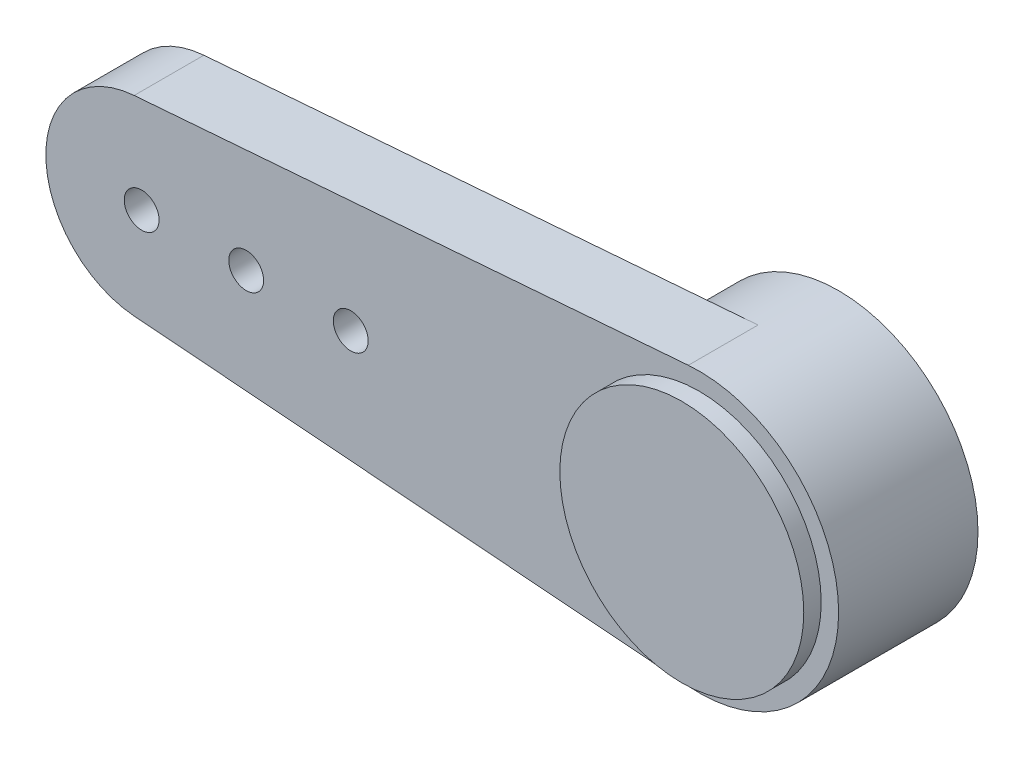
ISO-10303-21;
HEADER;
FILE_DESCRIPTION(('STEP AP214'),'2;1');
FILE_NAME('part.step','',(''),(''),'','','');
FILE_SCHEMA(('AUTOMOTIVE_DESIGN { 1 0 10303 214 1 1 1 1 }'));
ENDSEC;
DATA;
#1=APPLICATION_CONTEXT('core data for automotive mechanical design processes');
#2=APPLICATION_PROTOCOL_DEFINITION('international standard','automotive_design',2000,#1);
#3=PRODUCT_CONTEXT('',#1,'mechanical');
#4=PRODUCT('Part','Part','',(#3));
#5=PRODUCT_RELATED_PRODUCT_CATEGORY('part','',(#4));
#6=PRODUCT_DEFINITION_FORMATION('','',#4);
#7=PRODUCT_DEFINITION_CONTEXT('part definition',#1,'design');
#8=PRODUCT_DEFINITION('design','',#6,#7);
#9=PRODUCT_DEFINITION_SHAPE('','',#8);
#10=(LENGTH_UNIT() NAMED_UNIT(*) SI_UNIT(.MILLI.,.METRE.));
#11=(NAMED_UNIT(*) PLANE_ANGLE_UNIT() SI_UNIT($,.RADIAN.));
#12=(NAMED_UNIT(*) SI_UNIT($,.STERADIAN.) SOLID_ANGLE_UNIT());
#13=UNCERTAINTY_MEASURE_WITH_UNIT(LENGTH_MEASURE(1.E-05),#10,'distance_accuracy_value','');
#14=(GEOMETRIC_REPRESENTATION_CONTEXT(3) GLOBAL_UNCERTAINTY_ASSIGNED_CONTEXT((#13)) GLOBAL_UNIT_ASSIGNED_CONTEXT((#10,
#11,#12)) REPRESENTATION_CONTEXT('',''));
#15=CARTESIAN_POINT('',(0.,0.,0.));
#16=DIRECTION('',(0.,0.,1.));
#17=DIRECTION('',(1.,0.,0.));
#18=AXIS2_PLACEMENT_3D('',#15,#16,#17);
#19=CARTESIAN_POINT('',(0.,0.,0.));
#20=DIRECTION('',(0.,0.,1.));
#21=DIRECTION('',(1.,0.,0.));
#22=AXIS2_PLACEMENT_3D('',#19,#20,#21);
#23=PLANE('',#22);
#24=CARTESIAN_POINT('',(-10.,0.,0.));
#25=DIRECTION('',(0.,0.,1.));
#26=DIRECTION('',(1.,0.,0.));
#27=AXIS2_PLACEMENT_3D('',#24,#25,#26);
#28=CIRCLE('',#27,0.500000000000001);
#29=CARTESIAN_POINT('',(-9.5,0.,0.));
#30=VERTEX_POINT('',#29);
#31=EDGE_CURVE('E130',#30,#30,#28,.T.);
#32=ORIENTED_EDGE('',*,*,#31,.T.);
#33=EDGE_LOOP('',(#32));
#34=FACE_BOUND('',#33,.T.);
#35=CARTESIAN_POINT('',(-16.,0.,0.));
#36=DIRECTION('',(0.,0.,1.));
#37=DIRECTION('',(1.,0.,0.));
#38=AXIS2_PLACEMENT_3D('',#35,#36,#37);
#39=CIRCLE('',#38,0.500000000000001);
#40=CARTESIAN_POINT('',(-15.5,0.,0.));
#41=VERTEX_POINT('',#40);
#42=EDGE_CURVE('E118',#41,#41,#39,.T.);
#43=ORIENTED_EDGE('',*,*,#42,.T.);
#44=EDGE_LOOP('',(#43));
#45=FACE_BOUND('',#44,.T.);
#46=CARTESIAN_POINT('',(-13.,0.,0.));
#47=DIRECTION('',(0.,0.,1.));
#48=DIRECTION('',(1.,0.,0.));
#49=AXIS2_PLACEMENT_3D('',#46,#47,#48);
#50=CIRCLE('',#49,0.500000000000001);
#51=CARTESIAN_POINT('',(-12.5,0.,0.));
#52=VERTEX_POINT('',#51);
#53=EDGE_CURVE('E124',#52,#52,#50,.T.);
#54=ORIENTED_EDGE('',*,*,#53,.T.);
#55=EDGE_LOOP('',(#54));
#56=FACE_BOUND('',#55,.T.);
#57=CARTESIAN_POINT('',(0.,0.,0.));
#58=DIRECTION('',(0.,0.,-1.));
#59=DIRECTION('',(-1.,0.,0.));
#60=AXIS2_PLACEMENT_3D('',#57,#58,#59);
#61=CIRCLE('',#60,4.);
#62=CARTESIAN_POINT('',(-0.3125,-3.98777428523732,0.));
#63=VERTEX_POINT('',#62);
#64=CARTESIAN_POINT('',(-0.3125,3.98777428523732,0.));
#65=VERTEX_POINT('',#64);
#66=EDGE_CURVE('E11',#63,#65,#61,.T.);
#67=ORIENTED_EDGE('',*,*,#66,.F.);
#68=DIRECTION('',(0.996943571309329,-0.078125,0.));
#69=VECTOR('',#68,1.);
#70=CARTESIAN_POINT('',(-16.21484375,-2.74159482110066,0.));
#71=LINE('',#70,#69);
#72=CARTESIAN_POINT('',(-16.21484375,-2.74159482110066,0.));
#73=VERTEX_POINT('',#72);
#74=EDGE_CURVE('E105',#73,#63,#71,.T.);
#75=ORIENTED_EDGE('',*,*,#74,.F.);
#76=CARTESIAN_POINT('',(-16.,0.,0.));
#77=DIRECTION('',(0.,0.,1.));
#78=DIRECTION('',(1.,0.,0.));
#79=AXIS2_PLACEMENT_3D('',#76,#77,#78);
#80=CIRCLE('',#79,2.75);
#81=CARTESIAN_POINT('',(-16.21484375,2.74159482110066,0.));
#82=VERTEX_POINT('',#81);
#83=EDGE_CURVE('E68',#82,#73,#80,.T.);
#84=ORIENTED_EDGE('',*,*,#83,.F.);
#85=DIRECTION('',(-0.996943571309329,-0.078125,0.));
#86=VECTOR('',#85,1.);
#87=CARTESIAN_POINT('',(-16.21484375,2.74159482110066,0.));
#88=LINE('',#87,#86);
#89=EDGE_CURVE('E86',#65,#82,#88,.T.);
#90=ORIENTED_EDGE('',*,*,#89,.F.);
#91=EDGE_LOOP('',(#67,#75,#84,#90));
#92=FACE_BOUND('',#91,.T.);
#93=ADVANCED_FACE('F34',(#34,#45,#56,#92),#23,.F.);
#94=CARTESIAN_POINT('',(0.,0.,2.));
#95=DIRECTION('',(0.,0.,1.));
#96=DIRECTION('',(1.,0.,0.));
#97=AXIS2_PLACEMENT_3D('',#94,#95,#96);
#98=PLANE('',#97);
#99=CARTESIAN_POINT('',(-10.,0.,2.));
#100=DIRECTION('',(0.,0.,1.));
#101=DIRECTION('',(1.,0.,0.));
#102=AXIS2_PLACEMENT_3D('',#99,#100,#101);
#103=CIRCLE('',#102,0.500000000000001);
#104=CARTESIAN_POINT('',(-9.5,0.,2.));
#105=VERTEX_POINT('',#104);
#106=EDGE_CURVE('E127',#105,#105,#103,.T.);
#107=ORIENTED_EDGE('',*,*,#106,.F.);
#108=EDGE_LOOP('',(#107));
#109=FACE_BOUND('',#108,.T.);
#110=CARTESIAN_POINT('',(-16.,0.,2.));
#111=DIRECTION('',(0.,0.,1.));
#112=DIRECTION('',(1.,0.,0.));
#113=AXIS2_PLACEMENT_3D('',#110,#111,#112);
#114=CIRCLE('',#113,0.500000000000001);
#115=CARTESIAN_POINT('',(-15.5,0.,2.));
#116=VERTEX_POINT('',#115);
#117=EDGE_CURVE('E91',#116,#116,#114,.T.);
#118=ORIENTED_EDGE('',*,*,#117,.F.);
#119=EDGE_LOOP('',(#118));
#120=FACE_BOUND('',#119,.T.);
#121=CARTESIAN_POINT('',(0.,0.,2.));
#122=DIRECTION('',(0.,0.,1.));
#123=DIRECTION('',(1.,0.,0.));
#124=AXIS2_PLACEMENT_3D('',#121,#122,#123);
#125=CIRCLE('',#124,4.);
#126=CARTESIAN_POINT('',(-0.3125,-3.98777428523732,2.));
#127=VERTEX_POINT('',#126);
#128=CARTESIAN_POINT('',(-0.3125,3.98777428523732,2.));
#129=VERTEX_POINT('',#128);
#130=EDGE_CURVE('E96',#127,#129,#125,.T.);
#131=ORIENTED_EDGE('',*,*,#130,.T.);
#132=DIRECTION('',(-0.996943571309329,-0.078125,0.));
#133=VECTOR('',#132,1.);
#134=CARTESIAN_POINT('',(-16.21484375,2.74159482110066,2.));
#135=LINE('',#134,#133);
#136=CARTESIAN_POINT('',(-16.21484375,2.74159482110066,2.));
#137=VERTEX_POINT('',#136);
#138=EDGE_CURVE('E82',#129,#137,#135,.T.);
#139=ORIENTED_EDGE('',*,*,#138,.T.);
#140=CARTESIAN_POINT('',(-16.,0.,2.));
#141=DIRECTION('',(0.,0.,1.));
#142=DIRECTION('',(1.,0.,0.));
#143=AXIS2_PLACEMENT_3D('',#140,#141,#142);
#144=CIRCLE('',#143,2.75);
#145=CARTESIAN_POINT('',(-16.21484375,-2.74159482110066,2.));
#146=VERTEX_POINT('',#145);
#147=EDGE_CURVE('E100',#137,#146,#144,.T.);
#148=ORIENTED_EDGE('',*,*,#147,.T.);
#149=DIRECTION('',(0.996943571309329,-0.078125,0.));
#150=VECTOR('',#149,1.);
#151=CARTESIAN_POINT('',(-16.21484375,-2.74159482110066,2.));
#152=LINE('',#151,#150);
#153=EDGE_CURVE('E53',#146,#127,#152,.T.);
#154=ORIENTED_EDGE('',*,*,#153,.T.);
#155=EDGE_LOOP('',(#131,#139,#148,#154));
#156=FACE_BOUND('',#155,.T.);
#157=CARTESIAN_POINT('',(-13.,0.,2.));
#158=DIRECTION('',(0.,0.,1.));
#159=DIRECTION('',(1.,0.,0.));
#160=AXIS2_PLACEMENT_3D('',#157,#158,#159);
#161=CIRCLE('',#160,0.500000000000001);
#162=CARTESIAN_POINT('',(-12.5,0.,2.));
#163=VERTEX_POINT('',#162);
#164=EDGE_CURVE('E121',#163,#163,#161,.T.);
#165=ORIENTED_EDGE('',*,*,#164,.F.);
#166=EDGE_LOOP('',(#165));
#167=FACE_BOUND('',#166,.T.);
#168=CARTESIAN_POINT('',(0.,0.,2.));
#169=DIRECTION('',(0.,0.,1.));
#170=DIRECTION('',(1.,0.,0.));
#171=AXIS2_PLACEMENT_3D('',#168,#169,#170);
#172=CIRCLE('',#171,3.5);
#173=CARTESIAN_POINT('',(3.5,0.,2.));
#174=VERTEX_POINT('',#173);
#175=EDGE_CURVE('E136',#174,#174,#172,.T.);
#176=ORIENTED_EDGE('',*,*,#175,.F.);
#177=EDGE_LOOP('',(#176));
#178=FACE_BOUND('',#177,.T.);
#179=ADVANCED_FACE('F166',(#109,#120,#156,#167,#178),#98,.T.);
#180=CARTESIAN_POINT('',(0.,0.,2.));
#181=DIRECTION('',(0.,0.,-1.));
#182=DIRECTION('',(-1.,0.,0.));
#183=AXIS2_PLACEMENT_3D('',#180,#181,#182);
#184=CYLINDRICAL_SURFACE('',#183,4.);
#185=DIRECTION('',(0.,0.,-1.));
#186=VECTOR('',#185,1.);
#187=CARTESIAN_POINT('',(-0.3125,-3.98777428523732,2.));
#188=LINE('',#187,#186);
#189=EDGE_CURVE('E95',#127,#63,#188,.T.);
#190=ORIENTED_EDGE('',*,*,#189,.T.);
#191=ORIENTED_EDGE('',*,*,#66,.T.);
#192=DIRECTION('',(0.,0.,-1.));
#193=VECTOR('',#192,1.);
#194=CARTESIAN_POINT('',(-0.3125,3.98777428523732,2.));
#195=LINE('',#194,#193);
#196=EDGE_CURVE('E44',#129,#65,#195,.T.);
#197=ORIENTED_EDGE('',*,*,#196,.F.);
#198=ORIENTED_EDGE('',*,*,#130,.F.);
#199=EDGE_LOOP('',(#190,#191,#197,#198));
#200=FACE_BOUND('',#199,.T.);
#201=CARTESIAN_POINT('',(0.,0.,-2.));
#202=DIRECTION('',(0.,0.,-1.));
#203=DIRECTION('',(-1.,0.,0.));
#204=AXIS2_PLACEMENT_3D('',#201,#202,#203);
#205=CIRCLE('',#204,4.);
#206=CARTESIAN_POINT('',(-4.,0.,-2.));
#207=VERTEX_POINT('',#206);
#208=EDGE_CURVE('E139',#207,#207,#205,.T.);
#209=ORIENTED_EDGE('',*,*,#208,.F.);
#210=EDGE_LOOP('',(#209));
#211=FACE_BOUND('',#210,.T.);
#212=ADVANCED_FACE('F36',(#200,#211),#184,.T.);
#213=CARTESIAN_POINT('',(-16.21484375,2.74159482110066,2.));
#214=DIRECTION('',(0.078125,-0.996943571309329,0.));
#215=DIRECTION('',(0.996943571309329,0.078125,0.));
#216=AXIS2_PLACEMENT_3D('',#213,#214,#215);
#217=PLANE('',#216);
#218=ORIENTED_EDGE('',*,*,#89,.T.);
#219=DIRECTION('',(0.,0.,-1.));
#220=VECTOR('',#219,1.);
#221=CARTESIAN_POINT('',(-16.21484375,2.74159482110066,2.));
#222=LINE('',#221,#220);
#223=EDGE_CURVE('E89',#137,#82,#222,.T.);
#224=ORIENTED_EDGE('',*,*,#223,.F.);
#225=ORIENTED_EDGE('',*,*,#138,.F.);
#226=ORIENTED_EDGE('',*,*,#196,.T.);
#227=EDGE_LOOP('',(#218,#224,#225,#226));
#228=FACE_BOUND('',#227,.T.);
#229=ADVANCED_FACE('F85',(#228),#217,.F.);
#230=CARTESIAN_POINT('',(-16.,0.,2.));
#231=DIRECTION('',(0.,0.,-1.));
#232=DIRECTION('',(-1.,0.,0.));
#233=AXIS2_PLACEMENT_3D('',#230,#231,#232);
#234=CYLINDRICAL_SURFACE('',#233,2.75);
#235=ORIENTED_EDGE('',*,*,#83,.T.);
#236=DIRECTION('',(0.,0.,-1.));
#237=VECTOR('',#236,1.);
#238=CARTESIAN_POINT('',(-16.21484375,-2.74159482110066,2.));
#239=LINE('',#238,#237);
#240=EDGE_CURVE('E98',#146,#73,#239,.T.);
#241=ORIENTED_EDGE('',*,*,#240,.F.);
#242=ORIENTED_EDGE('',*,*,#147,.F.);
#243=ORIENTED_EDGE('',*,*,#223,.T.);
#244=EDGE_LOOP('',(#235,#241,#242,#243));
#245=FACE_BOUND('',#244,.T.);
#246=ADVANCED_FACE('F171',(#245),#234,.T.);
#247=CARTESIAN_POINT('',(-16.21484375,-2.74159482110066,2.));
#248=DIRECTION('',(0.078125,0.996943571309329,0.));
#249=DIRECTION('',(-0.996943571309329,0.078125,0.));
#250=AXIS2_PLACEMENT_3D('',#247,#248,#249);
#251=PLANE('',#250);
#252=ORIENTED_EDGE('',*,*,#74,.T.);
#253=ORIENTED_EDGE('',*,*,#189,.F.);
#254=ORIENTED_EDGE('',*,*,#153,.F.);
#255=ORIENTED_EDGE('',*,*,#240,.T.);
#256=EDGE_LOOP('',(#252,#253,#254,#255));
#257=FACE_BOUND('',#256,.T.);
#258=ADVANCED_FACE('F182',(#257),#251,.F.);
#259=CARTESIAN_POINT('',(-16.,0.,2.));
#260=DIRECTION('',(0.,0.,-1.));
#261=DIRECTION('',(-1.,0.,0.));
#262=AXIS2_PLACEMENT_3D('',#259,#260,#261);
#263=CYLINDRICAL_SURFACE('',#262,0.500000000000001);
#264=ORIENTED_EDGE('',*,*,#117,.T.);
#265=EDGE_LOOP('',(#264));
#266=FACE_BOUND('',#265,.T.);
#267=ORIENTED_EDGE('',*,*,#42,.F.);
#268=EDGE_LOOP('',(#267));
#269=FACE_BOUND('',#268,.T.);
#270=ADVANCED_FACE('F185',(#266,#269),#263,.F.);
#271=CARTESIAN_POINT('',(-13.,0.,2.));
#272=DIRECTION('',(0.,0.,-1.));
#273=DIRECTION('',(-1.,0.,0.));
#274=AXIS2_PLACEMENT_3D('',#271,#272,#273);
#275=CYLINDRICAL_SURFACE('',#274,0.500000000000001);
#276=ORIENTED_EDGE('',*,*,#164,.T.);
#277=EDGE_LOOP('',(#276));
#278=FACE_BOUND('',#277,.T.);
#279=ORIENTED_EDGE('',*,*,#53,.F.);
#280=EDGE_LOOP('',(#279));
#281=FACE_BOUND('',#280,.T.);
#282=ADVANCED_FACE('F202',(#278,#281),#275,.F.);
#283=CARTESIAN_POINT('',(-10.,0.,2.));
#284=DIRECTION('',(0.,0.,-1.));
#285=DIRECTION('',(-1.,0.,0.));
#286=AXIS2_PLACEMENT_3D('',#283,#284,#285);
#287=CYLINDRICAL_SURFACE('',#286,0.500000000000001);
#288=ORIENTED_EDGE('',*,*,#106,.T.);
#289=EDGE_LOOP('',(#288));
#290=FACE_BOUND('',#289,.T.);
#291=ORIENTED_EDGE('',*,*,#31,.F.);
#292=EDGE_LOOP('',(#291));
#293=FACE_BOUND('',#292,.T.);
#294=ADVANCED_FACE('F209',(#290,#293),#287,.F.);
#295=CARTESIAN_POINT('',(0.,0.,2.5));
#296=DIRECTION('',(0.,0.,-1.));
#297=DIRECTION('',(-1.,0.,0.));
#298=AXIS2_PLACEMENT_3D('',#295,#296,#297);
#299=CYLINDRICAL_SURFACE('',#298,3.5);
#300=CARTESIAN_POINT('',(0.,0.,2.5));
#301=DIRECTION('',(0.,0.,1.));
#302=DIRECTION('',(1.,0.,0.));
#303=AXIS2_PLACEMENT_3D('',#300,#301,#302);
#304=CIRCLE('',#303,3.5);
#305=CARTESIAN_POINT('',(3.5,0.,2.5));
#306=VERTEX_POINT('',#305);
#307=EDGE_CURVE('E133',#306,#306,#304,.T.);
#308=ORIENTED_EDGE('',*,*,#307,.F.);
#309=EDGE_LOOP('',(#308));
#310=FACE_BOUND('',#309,.T.);
#311=ORIENTED_EDGE('',*,*,#175,.T.);
#312=EDGE_LOOP('',(#311));
#313=FACE_BOUND('',#312,.T.);
#314=ADVANCED_FACE('F217',(#310,#313),#299,.T.);
#315=CARTESIAN_POINT('',(0.,0.,2.5));
#316=DIRECTION('',(0.,0.,1.));
#317=DIRECTION('',(1.,0.,0.));
#318=AXIS2_PLACEMENT_3D('',#315,#316,#317);
#319=PLANE('',#318);
#320=ORIENTED_EDGE('',*,*,#307,.T.);
#321=EDGE_LOOP('',(#320));
#322=FACE_BOUND('',#321,.T.);
#323=ADVANCED_FACE('F162',(#322),#319,.T.);
#324=CARTESIAN_POINT('',(0.,0.,-2.));
#325=DIRECTION('',(0.,0.,-1.));
#326=DIRECTION('',(-1.,0.,0.));
#327=AXIS2_PLACEMENT_3D('',#324,#325,#326);
#328=PLANE('',#327);
#329=CARTESIAN_POINT('',(0.,0.,-2.));
#330=DIRECTION('',(0.,0.,-1.));
#331=DIRECTION('',(-1.,0.,0.));
#332=AXIS2_PLACEMENT_3D('',#329,#330,#331);
#333=CIRCLE('',#332,2.5);
#334=CARTESIAN_POINT('',(-2.5,0.,-2.));
#335=VERTEX_POINT('',#334);
#336=EDGE_CURVE('E145',#335,#335,#333,.T.);
#337=ORIENTED_EDGE('',*,*,#336,.F.);
#338=EDGE_LOOP('',(#337));
#339=FACE_BOUND('',#338,.T.);
#340=ORIENTED_EDGE('',*,*,#208,.T.);
#341=EDGE_LOOP('',(#340));
#342=FACE_BOUND('',#341,.T.);
#343=ADVANCED_FACE('F156',(#339,#342),#328,.T.);
#344=CARTESIAN_POINT('',(0.,0.,0.7));
#345=DIRECTION('',(0.,0.,-1.));
#346=DIRECTION('',(-1.,0.,0.));
#347=AXIS2_PLACEMENT_3D('',#344,#345,#346);
#348=CYLINDRICAL_SURFACE('',#347,2.5);
#349=CARTESIAN_POINT('',(0.,0.,0.7));
#350=DIRECTION('',(0.,0.,-1.));
#351=DIRECTION('',(-1.,0.,0.));
#352=AXIS2_PLACEMENT_3D('',#349,#350,#351);
#353=CIRCLE('',#352,2.5);
#354=CARTESIAN_POINT('',(-2.5,0.,0.7));
#355=VERTEX_POINT('',#354);
#356=EDGE_CURVE('E144',#355,#355,#353,.T.);
#357=CARTESIAN_POINT('',(-2.5,0.,0.7));
#358=CARTESIAN_POINT('',(-2.5,0.,0.671875));
#359=CARTESIAN_POINT('',(-2.5,0.,0.64375));
#360=CARTESIAN_POINT('',(-2.5,0.,0.5875));
#361=CARTESIAN_POINT('',(-2.5,0.,0.559375));
#362=CARTESIAN_POINT('',(-2.5,0.,0.503125));
#363=CARTESIAN_POINT('',(-2.5,0.,0.475));
#364=CARTESIAN_POINT('',(-2.5,0.,0.41875));
#365=CARTESIAN_POINT('',(-2.5,0.,0.390625));
#366=CARTESIAN_POINT('',(-2.5,0.,0.334375));
#367=CARTESIAN_POINT('',(-2.5,0.,0.30625));
#368=CARTESIAN_POINT('',(-2.5,0.,0.25));
#369=CARTESIAN_POINT('',(-2.5,0.,0.221875));
#370=CARTESIAN_POINT('',(-2.5,0.,0.165625));
#371=CARTESIAN_POINT('',(-2.5,0.,0.1375));
#372=CARTESIAN_POINT('',(-2.5,0.,0.0812500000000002));
#373=CARTESIAN_POINT('',(-2.5,0.,0.0531250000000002));
#374=CARTESIAN_POINT('',(-2.5,0.,-0.00312499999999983));
#375=CARTESIAN_POINT('',(-2.5,0.,-0.0312499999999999));
#376=CARTESIAN_POINT('',(-2.5,0.,-0.0874999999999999));
#377=CARTESIAN_POINT('',(-2.5,0.,-0.115625));
#378=CARTESIAN_POINT('',(-2.5,0.,-0.171875));
#379=CARTESIAN_POINT('',(-2.5,0.,-0.2));
#380=CARTESIAN_POINT('',(-2.5,0.,-0.25625));
#381=CARTESIAN_POINT('',(-2.5,0.,-0.284375));
#382=CARTESIAN_POINT('',(-2.5,0.,-0.340625));
#383=CARTESIAN_POINT('',(-2.5,0.,-0.36875));
#384=CARTESIAN_POINT('',(-2.5,0.,-0.425));
#385=CARTESIAN_POINT('',(-2.5,0.,-0.453125));
#386=CARTESIAN_POINT('',(-2.5,0.,-0.509375));
#387=CARTESIAN_POINT('',(-2.5,0.,-0.5375));
#388=CARTESIAN_POINT('',(-2.5,0.,-0.59375));
#389=CARTESIAN_POINT('',(-2.5,0.,-0.621875));
#390=CARTESIAN_POINT('',(-2.5,0.,-0.678125));
#391=CARTESIAN_POINT('',(-2.5,0.,-0.70625));
#392=CARTESIAN_POINT('',(-2.5,0.,-0.7625));
#393=CARTESIAN_POINT('',(-2.5,0.,-0.790625));
#394=CARTESIAN_POINT('',(-2.5,0.,-0.846875));
#395=CARTESIAN_POINT('',(-2.5,0.,-0.875));
#396=CARTESIAN_POINT('',(-2.5,0.,-0.93125));
#397=CARTESIAN_POINT('',(-2.5,0.,-0.959375));
#398=CARTESIAN_POINT('',(-2.5,0.,-1.015625));
#399=CARTESIAN_POINT('',(-2.5,0.,-1.04375));
#400=CARTESIAN_POINT('',(-2.5,0.,-1.1));
#401=CARTESIAN_POINT('',(-2.5,0.,-1.128125));
#402=CARTESIAN_POINT('',(-2.5,0.,-1.184375));
#403=CARTESIAN_POINT('',(-2.5,0.,-1.2125));
#404=CARTESIAN_POINT('',(-2.5,0.,-1.26875));
#405=CARTESIAN_POINT('',(-2.5,0.,-1.296875));
#406=CARTESIAN_POINT('',(-2.5,0.,-1.353125));
#407=CARTESIAN_POINT('',(-2.5,0.,-1.38125));
#408=CARTESIAN_POINT('',(-2.5,0.,-1.4375));
#409=CARTESIAN_POINT('',(-2.5,0.,-1.465625));
#410=CARTESIAN_POINT('',(-2.5,0.,-1.521875));
#411=CARTESIAN_POINT('',(-2.5,0.,-1.55));
#412=CARTESIAN_POINT('',(-2.5,0.,-1.60625));
#413=CARTESIAN_POINT('',(-2.5,0.,-1.634375));
#414=CARTESIAN_POINT('',(-2.5,0.,-1.690625));
#415=CARTESIAN_POINT('',(-2.5,0.,-1.71875));
#416=CARTESIAN_POINT('',(-2.5,0.,-1.775));
#417=CARTESIAN_POINT('',(-2.5,0.,-1.803125));
#418=CARTESIAN_POINT('',(-2.5,0.,-1.859375));
#419=CARTESIAN_POINT('',(-2.5,0.,-1.8875));
#420=CARTESIAN_POINT('',(-2.5,0.,-1.94375));
#421=CARTESIAN_POINT('',(-2.5,0.,-1.971875));
#422=CARTESIAN_POINT('',(-2.5,0.,-2.));
#423=B_SPLINE_CURVE_WITH_KNOTS('',3,(#357,#358,#359,#360,#361,#362,#363,#364,#365,#366,#367,
#368,#369,#370,#371,#372,#373,#374,#375,#376,#377,#378,#379,#380,#381,#382,#383,#384,#385,#386,
#387,#388,#389,#390,#391,#392,#393,#394,#395,#396,#397,#398,#399,#400,#401,#402,#403,#404,#405,
#406,#407,#408,#409,#410,#411,#412,#413,#414,#415,#416,#417,#418,#419,#420,#421,#422),
.UNSPECIFIED.,.F.,.F.,(4,2,2,2,2,2,2,2,2,2,2,2,2,2,2,2,2,2,2,2,2,2,2,2,2,2,2,2,2,2,2,2,4),(0.,
0.0843749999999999,0.16875,0.253125,0.3375,0.421875,0.50625,0.590625,0.675,0.759375,0.84375,
0.928125,1.0125,1.096875,1.18125,1.265625,1.35,1.434375,1.51875,1.603125,1.6875,1.771875,
1.85625,1.940625,2.025,2.109375,2.19375,2.278125,2.3625,2.446875,2.53125,2.615625,2.7),.UNSPECIFIED.);
#424=EDGE_CURVE('BSEAM153',#355,#335,#423,.T.);
#425=ORIENTED_EDGE('',*,*,#356,.F.);
#426=ORIENTED_EDGE('',*,*,#336,.T.);
#427=ORIENTED_EDGE('',*,*,#424,.T.);
#428=ORIENTED_EDGE('',*,*,#424,.F.);
#429=EDGE_LOOP('',(#425,#427,#426,#428));
#430=FACE_BOUND('',#429,.T.);
#431=ADVANCED_FACE('F153',(#430),#348,.F.);
#432=CARTESIAN_POINT('',(0.,0.,0.7));
#433=DIRECTION('',(0.,0.,-1.));
#434=DIRECTION('',(-1.,0.,0.));
#435=AXIS2_PLACEMENT_3D('',#432,#433,#434);
#436=PLANE('',#435);
#437=ORIENTED_EDGE('',*,*,#356,.T.);
#438=EDGE_LOOP('',(#437));
#439=FACE_BOUND('',#438,.T.);
#440=ADVANCED_FACE('F151',(#439),#436,.T.);
#441=CLOSED_SHELL('',(#93,#179,#212,#229,#246,#258,#270,#282,#294,#314,#323,#343,#431,#440));
#442=MANIFOLD_SOLID_BREP('B2',#441);
#443=ADVANCED_BREP_SHAPE_REPRESENTATION('',(#18,#442),#14);
#444=SHAPE_DEFINITION_REPRESENTATION(#9,#443);
ENDSEC;
END-ISO-10303-21;
